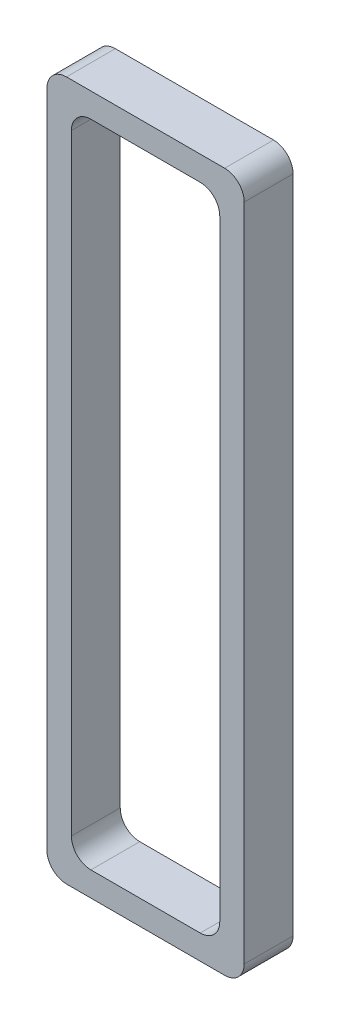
ISO-10303-21;
HEADER;
FILE_DESCRIPTION(('STEP AP214'),'2;1');
FILE_NAME('part.step','',(''),(''),'','','');
FILE_SCHEMA(('AUTOMOTIVE_DESIGN { 1 0 10303 214 1 1 1 1 }'));
ENDSEC;
DATA;
#1=APPLICATION_CONTEXT('core data for automotive mechanical design processes');
#2=APPLICATION_PROTOCOL_DEFINITION('international standard','automotive_design',2000,#1);
#3=PRODUCT_CONTEXT('',#1,'mechanical');
#4=PRODUCT('Part','Part','',(#3));
#5=PRODUCT_RELATED_PRODUCT_CATEGORY('part','',(#4));
#6=PRODUCT_DEFINITION_FORMATION('','',#4);
#7=PRODUCT_DEFINITION_CONTEXT('part definition',#1,'design');
#8=PRODUCT_DEFINITION('design','',#6,#7);
#9=PRODUCT_DEFINITION_SHAPE('','',#8);
#10=(LENGTH_UNIT() NAMED_UNIT(*) SI_UNIT(.MILLI.,.METRE.));
#11=(NAMED_UNIT(*) PLANE_ANGLE_UNIT() SI_UNIT($,.RADIAN.));
#12=(NAMED_UNIT(*) SI_UNIT($,.STERADIAN.) SOLID_ANGLE_UNIT());
#13=UNCERTAINTY_MEASURE_WITH_UNIT(LENGTH_MEASURE(1.E-05),#10,'distance_accuracy_value','');
#14=(GEOMETRIC_REPRESENTATION_CONTEXT(3) GLOBAL_UNCERTAINTY_ASSIGNED_CONTEXT((#13)) GLOBAL_UNIT_ASSIGNED_CONTEXT((#10,
#11,#12)) REPRESENTATION_CONTEXT('',''));
#15=CARTESIAN_POINT('',(0.,0.,0.));
#16=DIRECTION('',(0.,0.,1.));
#17=DIRECTION('',(1.,0.,0.));
#18=AXIS2_PLACEMENT_3D('',#15,#16,#17);
#19=CARTESIAN_POINT('',(23.0898604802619,12.065,6.35));
#20=DIRECTION('',(0.,0.,-1.));
#21=DIRECTION('',(-1.,0.,0.));
#22=AXIS2_PLACEMENT_3D('',#19,#20,#21);
#23=PLANE('',#22);
#24=CARTESIAN_POINT('',(23.0898604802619,12.065,6.35));
#25=DIRECTION('',(0.,0.,1.));
#26=DIRECTION('',(-1.,0.,0.));
#27=AXIS2_PLACEMENT_3D('',#24,#25,#26);
#28=CIRCLE('',#27,2.54);
#29=CARTESIAN_POINT('',(25.6298604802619,12.065,6.35));
#30=VERTEX_POINT('',#29);
#31=CARTESIAN_POINT('',(23.0898604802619,14.605,6.35));
#32=VERTEX_POINT('',#31);
#33=EDGE_CURVE('E208',#30,#32,#28,.T.);
#34=ORIENTED_EDGE('',*,*,#33,.T.);
#35=DIRECTION('',(-1.,0.,0.));
#36=VECTOR('',#35,1.);
#37=CARTESIAN_POINT('',(2.54,14.605,6.35));
#38=LINE('',#37,#36);
#39=CARTESIAN_POINT('',(2.54,14.605,6.35));
#40=VERTEX_POINT('',#39);
#41=EDGE_CURVE('E211',#32,#40,#38,.T.);
#42=ORIENTED_EDGE('',*,*,#41,.T.);
#43=CARTESIAN_POINT('',(2.54,12.065,6.35));
#44=DIRECTION('',(0.,0.,1.));
#45=DIRECTION('',(1.,0.,0.));
#46=AXIS2_PLACEMENT_3D('',#43,#44,#45);
#47=CIRCLE('',#46,2.54);
#48=CARTESIAN_POINT('',(0.,12.065,6.35));
#49=VERTEX_POINT('',#48);
#50=EDGE_CURVE('E214',#40,#49,#47,.T.);
#51=ORIENTED_EDGE('',*,*,#50,.T.);
#52=DIRECTION('',(0.,-1.,0.));
#53=VECTOR('',#52,1.);
#54=CARTESIAN_POINT('',(0.,-73.66,6.35));
#55=LINE('',#54,#53);
#56=CARTESIAN_POINT('',(0.,-73.66,6.35));
#57=VERTEX_POINT('',#56);
#58=EDGE_CURVE('E216',#49,#57,#55,.T.);
#59=ORIENTED_EDGE('',*,*,#58,.T.);
#60=CARTESIAN_POINT('',(2.54,-73.66,6.35));
#61=DIRECTION('',(0.,0.,1.));
#62=DIRECTION('',(-1.,0.,0.));
#63=AXIS2_PLACEMENT_3D('',#60,#61,#62);
#64=CIRCLE('',#63,2.54);
#65=CARTESIAN_POINT('',(2.54000000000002,-76.2,6.35));
#66=VERTEX_POINT('',#65);
#67=EDGE_CURVE('E218',#57,#66,#64,.T.);
#68=ORIENTED_EDGE('',*,*,#67,.T.);
#69=DIRECTION('',(1.,0.,0.));
#70=VECTOR('',#69,1.);
#71=CARTESIAN_POINT('',(23.0898604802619,-76.2,6.35));
#72=LINE('',#71,#70);
#73=CARTESIAN_POINT('',(23.0898604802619,-76.2,6.35));
#74=VERTEX_POINT('',#73);
#75=EDGE_CURVE('E220',#66,#74,#72,.T.);
#76=ORIENTED_EDGE('',*,*,#75,.T.);
#77=CARTESIAN_POINT('',(23.089860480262,-73.66,6.35));
#78=DIRECTION('',(0.,0.,1.));
#79=DIRECTION('',(-1.,0.,0.));
#80=AXIS2_PLACEMENT_3D('',#77,#78,#79);
#81=CIRCLE('',#80,2.54);
#82=CARTESIAN_POINT('',(25.629860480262,-73.66,6.35));
#83=VERTEX_POINT('',#82);
#84=EDGE_CURVE('E222',#74,#83,#81,.T.);
#85=ORIENTED_EDGE('',*,*,#84,.T.);
#86=DIRECTION('',(0.,1.,0.));
#87=VECTOR('',#86,1.);
#88=CARTESIAN_POINT('',(25.6298604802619,12.065,6.35));
#89=LINE('',#88,#87);
#90=EDGE_CURVE('E224',#83,#30,#89,.T.);
#91=ORIENTED_EDGE('',*,*,#90,.T.);
#92=EDGE_LOOP('',(#34,#42,#51,#59,#68,#76,#85,#91));
#93=FACE_BOUND('',#92,.T.);
#94=CARTESIAN_POINT('',(19.9148604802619,8.89,6.35));
#95=DIRECTION('',(0.,0.,1.));
#96=DIRECTION('',(-1.,0.,0.));
#97=AXIS2_PLACEMENT_3D('',#94,#95,#96);
#98=CIRCLE('',#97,2.54);
#99=CARTESIAN_POINT('',(22.4548604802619,8.89,6.35));
#100=VERTEX_POINT('',#99);
#101=CARTESIAN_POINT('',(19.9148604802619,11.43,6.35));
#102=VERTEX_POINT('',#101);
#103=EDGE_CURVE('E143',#100,#102,#98,.T.);
#104=ORIENTED_EDGE('',*,*,#103,.F.);
#105=DIRECTION('',(0.,1.,0.));
#106=VECTOR('',#105,1.);
#107=CARTESIAN_POINT('',(22.4548604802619,8.89,6.35));
#108=LINE('',#107,#106);
#109=CARTESIAN_POINT('',(22.4548604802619,-70.485,6.35));
#110=VERTEX_POINT('',#109);
#111=EDGE_CURVE('E176',#110,#100,#108,.T.);
#112=ORIENTED_EDGE('',*,*,#111,.F.);
#113=CARTESIAN_POINT('',(19.9148604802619,-70.485,6.35));
#114=DIRECTION('',(0.,0.,1.));
#115=DIRECTION('',(-1.,0.,0.));
#116=AXIS2_PLACEMENT_3D('',#113,#114,#115);
#117=CIRCLE('',#116,2.54);
#118=CARTESIAN_POINT('',(19.9148604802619,-73.025,6.35));
#119=VERTEX_POINT('',#118);
#120=EDGE_CURVE('E174',#119,#110,#117,.T.);
#121=ORIENTED_EDGE('',*,*,#120,.F.);
#122=DIRECTION('',(1.,0.,0.));
#123=VECTOR('',#122,1.);
#124=CARTESIAN_POINT('',(19.9148604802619,-73.025,6.35));
#125=LINE('',#124,#123);
#126=CARTESIAN_POINT('',(5.71500000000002,-73.025,6.35));
#127=VERTEX_POINT('',#126);
#128=EDGE_CURVE('E172',#127,#119,#125,.T.);
#129=ORIENTED_EDGE('',*,*,#128,.F.);
#130=CARTESIAN_POINT('',(5.715,-70.485,6.35));
#131=DIRECTION('',(0.,0.,1.));
#132=DIRECTION('',(-1.,0.,0.));
#133=AXIS2_PLACEMENT_3D('',#130,#131,#132);
#134=CIRCLE('',#133,2.54);
#135=CARTESIAN_POINT('',(3.175,-70.485,6.35));
#136=VERTEX_POINT('',#135);
#137=EDGE_CURVE('E170',#136,#127,#134,.T.);
#138=ORIENTED_EDGE('',*,*,#137,.F.);
#139=DIRECTION('',(0.,-1.,0.));
#140=VECTOR('',#139,1.);
#141=CARTESIAN_POINT('',(3.175,-70.485,6.35));
#142=LINE('',#141,#140);
#143=CARTESIAN_POINT('',(3.175,8.89,6.35));
#144=VERTEX_POINT('',#143);
#145=EDGE_CURVE('E166',#144,#136,#142,.T.);
#146=ORIENTED_EDGE('',*,*,#145,.F.);
#147=CARTESIAN_POINT('',(5.715,8.89,6.35));
#148=DIRECTION('',(0.,0.,1.));
#149=DIRECTION('',(1.,0.,0.));
#150=AXIS2_PLACEMENT_3D('',#147,#148,#149);
#151=CIRCLE('',#150,2.54);
#152=CARTESIAN_POINT('',(5.715,11.43,6.35));
#153=VERTEX_POINT('',#152);
#154=EDGE_CURVE('E164',#153,#144,#151,.T.);
#155=ORIENTED_EDGE('',*,*,#154,.F.);
#156=DIRECTION('',(-1.,0.,0.));
#157=VECTOR('',#156,1.);
#158=CARTESIAN_POINT('',(5.715,11.43,6.35));
#159=LINE('',#158,#157);
#160=EDGE_CURVE('E151',#102,#153,#159,.T.);
#161=ORIENTED_EDGE('',*,*,#160,.F.);
#162=EDGE_LOOP('',(#104,#112,#121,#129,#138,#146,#155,#161));
#163=FACE_BOUND('',#162,.T.);
#164=ADVANCED_FACE('F30',(#93,#163),#23,.F.);
#165=CARTESIAN_POINT('',(23.0898604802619,12.065,0.));
#166=DIRECTION('',(0.,0.,-1.));
#167=DIRECTION('',(-1.,0.,0.));
#168=AXIS2_PLACEMENT_3D('',#165,#166,#167);
#169=PLANE('',#168);
#170=CARTESIAN_POINT('',(23.0898604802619,12.065,0.));
#171=DIRECTION('',(0.,0.,1.));
#172=DIRECTION('',(-1.,0.,0.));
#173=AXIS2_PLACEMENT_3D('',#170,#171,#172);
#174=CIRCLE('',#173,2.54);
#175=CARTESIAN_POINT('',(25.6298604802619,12.065,0.));
#176=VERTEX_POINT('',#175);
#177=CARTESIAN_POINT('',(23.0898604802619,14.605,0.));
#178=VERTEX_POINT('',#177);
#179=EDGE_CURVE('E159',#176,#178,#174,.T.);
#180=ORIENTED_EDGE('',*,*,#179,.F.);
#181=DIRECTION('',(0.,1.,0.));
#182=VECTOR('',#181,1.);
#183=CARTESIAN_POINT('',(25.6298604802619,12.065,0.));
#184=LINE('',#183,#182);
#185=CARTESIAN_POINT('',(25.629860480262,-73.66,0.));
#186=VERTEX_POINT('',#185);
#187=EDGE_CURVE('E212',#186,#176,#184,.T.);
#188=ORIENTED_EDGE('',*,*,#187,.F.);
#189=CARTESIAN_POINT('',(23.089860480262,-73.66,0.));
#190=DIRECTION('',(0.,0.,1.));
#191=DIRECTION('',(-1.,0.,0.));
#192=AXIS2_PLACEMENT_3D('',#189,#190,#191);
#193=CIRCLE('',#192,2.54);
#194=CARTESIAN_POINT('',(23.0898604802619,-76.2,0.));
#195=VERTEX_POINT('',#194);
#196=EDGE_CURVE('E239',#195,#186,#193,.T.);
#197=ORIENTED_EDGE('',*,*,#196,.F.);
#198=DIRECTION('',(1.,0.,0.));
#199=VECTOR('',#198,1.);
#200=CARTESIAN_POINT('',(23.0898604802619,-76.2,0.));
#201=LINE('',#200,#199);
#202=CARTESIAN_POINT('',(2.54000000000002,-76.2,0.));
#203=VERTEX_POINT('',#202);
#204=EDGE_CURVE('E237',#203,#195,#201,.T.);
#205=ORIENTED_EDGE('',*,*,#204,.F.);
#206=CARTESIAN_POINT('',(2.54,-73.66,0.));
#207=DIRECTION('',(0.,0.,1.));
#208=DIRECTION('',(-1.,0.,0.));
#209=AXIS2_PLACEMENT_3D('',#206,#207,#208);
#210=CIRCLE('',#209,2.54);
#211=CARTESIAN_POINT('',(0.,-73.66,0.));
#212=VERTEX_POINT('',#211);
#213=EDGE_CURVE('E235',#212,#203,#210,.T.);
#214=ORIENTED_EDGE('',*,*,#213,.F.);
#215=DIRECTION('',(0.,-1.,0.));
#216=VECTOR('',#215,1.);
#217=CARTESIAN_POINT('',(0.,-73.66,0.));
#218=LINE('',#217,#216);
#219=CARTESIAN_POINT('',(0.,12.065,0.));
#220=VERTEX_POINT('',#219);
#221=EDGE_CURVE('E233',#220,#212,#218,.T.);
#222=ORIENTED_EDGE('',*,*,#221,.F.);
#223=CARTESIAN_POINT('',(2.54,12.065,0.));
#224=DIRECTION('',(0.,0.,1.));
#225=DIRECTION('',(1.,0.,0.));
#226=AXIS2_PLACEMENT_3D('',#223,#224,#225);
#227=CIRCLE('',#226,2.54);
#228=CARTESIAN_POINT('',(2.54,14.605,0.));
#229=VERTEX_POINT('',#228);
#230=EDGE_CURVE('E231',#229,#220,#227,.T.);
#231=ORIENTED_EDGE('',*,*,#230,.F.);
#232=DIRECTION('',(-1.,0.,0.));
#233=VECTOR('',#232,1.);
#234=CARTESIAN_POINT('',(2.54,14.605,0.));
#235=LINE('',#234,#233);
#236=EDGE_CURVE('E229',#178,#229,#235,.T.);
#237=ORIENTED_EDGE('',*,*,#236,.F.);
#238=EDGE_LOOP('',(#180,#188,#197,#205,#214,#222,#231,#237));
#239=FACE_BOUND('',#238,.T.);
#240=DIRECTION('',(0.,1.,0.));
#241=VECTOR('',#240,1.);
#242=CARTESIAN_POINT('',(22.4548604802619,8.89,0.));
#243=LINE('',#242,#241);
#244=CARTESIAN_POINT('',(22.4548604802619,-70.485,0.));
#245=VERTEX_POINT('',#244);
#246=CARTESIAN_POINT('',(22.4548604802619,8.89,0.));
#247=VERTEX_POINT('',#246);
#248=EDGE_CURVE('E152',#245,#247,#243,.T.);
#249=ORIENTED_EDGE('',*,*,#248,.T.);
#250=CARTESIAN_POINT('',(19.9148604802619,8.89,0.));
#251=DIRECTION('',(0.,0.,1.));
#252=DIRECTION('',(-1.,0.,0.));
#253=AXIS2_PLACEMENT_3D('',#250,#251,#252);
#254=CIRCLE('',#253,2.54);
#255=CARTESIAN_POINT('',(19.9148604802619,11.43,0.));
#256=VERTEX_POINT('',#255);
#257=EDGE_CURVE('E53',#247,#256,#254,.T.);
#258=ORIENTED_EDGE('',*,*,#257,.T.);
#259=DIRECTION('',(-1.,0.,0.));
#260=VECTOR('',#259,1.);
#261=CARTESIAN_POINT('',(5.715,11.43,0.));
#262=LINE('',#261,#260);
#263=CARTESIAN_POINT('',(5.715,11.43,0.));
#264=VERTEX_POINT('',#263);
#265=EDGE_CURVE('E158',#256,#264,#262,.T.);
#266=ORIENTED_EDGE('',*,*,#265,.T.);
#267=CARTESIAN_POINT('',(5.715,8.89,0.));
#268=DIRECTION('',(0.,0.,1.));
#269=DIRECTION('',(1.,0.,0.));
#270=AXIS2_PLACEMENT_3D('',#267,#268,#269);
#271=CIRCLE('',#270,2.54);
#272=CARTESIAN_POINT('',(3.175,8.89,0.));
#273=VERTEX_POINT('',#272);
#274=EDGE_CURVE('E180',#264,#273,#271,.T.);
#275=ORIENTED_EDGE('',*,*,#274,.T.);
#276=DIRECTION('',(0.,-1.,0.));
#277=VECTOR('',#276,1.);
#278=CARTESIAN_POINT('',(3.175,-70.485,0.));
#279=LINE('',#278,#277);
#280=CARTESIAN_POINT('',(3.175,-70.485,0.));
#281=VERTEX_POINT('',#280);
#282=EDGE_CURVE('E183',#273,#281,#279,.T.);
#283=ORIENTED_EDGE('',*,*,#282,.T.);
#284=CARTESIAN_POINT('',(5.715,-70.485,0.));
#285=DIRECTION('',(0.,0.,1.));
#286=DIRECTION('',(-1.,0.,0.));
#287=AXIS2_PLACEMENT_3D('',#284,#285,#286);
#288=CIRCLE('',#287,2.54);
#289=CARTESIAN_POINT('',(5.71500000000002,-73.025,0.));
#290=VERTEX_POINT('',#289);
#291=EDGE_CURVE('E186',#281,#290,#288,.T.);
#292=ORIENTED_EDGE('',*,*,#291,.T.);
#293=DIRECTION('',(1.,0.,0.));
#294=VECTOR('',#293,1.);
#295=CARTESIAN_POINT('',(19.9148604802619,-73.025,0.));
#296=LINE('',#295,#294);
#297=CARTESIAN_POINT('',(19.9148604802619,-73.025,0.));
#298=VERTEX_POINT('',#297);
#299=EDGE_CURVE('E189',#290,#298,#296,.T.);
#300=ORIENTED_EDGE('',*,*,#299,.T.);
#301=CARTESIAN_POINT('',(19.9148604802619,-70.485,0.));
#302=DIRECTION('',(0.,0.,1.));
#303=DIRECTION('',(-1.,0.,0.));
#304=AXIS2_PLACEMENT_3D('',#301,#302,#303);
#305=CIRCLE('',#304,2.54);
#306=EDGE_CURVE('E192',#298,#245,#305,.T.);
#307=ORIENTED_EDGE('',*,*,#306,.T.);
#308=EDGE_LOOP('',(#249,#258,#266,#275,#283,#292,#300,#307));
#309=FACE_BOUND('',#308,.T.);
#310=ADVANCED_FACE('F269',(#239,#309),#169,.T.);
#311=CARTESIAN_POINT('',(23.0898604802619,12.065,6.35));
#312=DIRECTION('',(0.,0.,-1.));
#313=DIRECTION('',(-1.,0.,0.));
#314=AXIS2_PLACEMENT_3D('',#311,#312,#313);
#315=CYLINDRICAL_SURFACE('',#314,2.54);
#316=ORIENTED_EDGE('',*,*,#179,.T.);
#317=DIRECTION('',(0.,0.,-1.));
#318=VECTOR('',#317,1.);
#319=CARTESIAN_POINT('',(23.0898604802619,14.605,6.35));
#320=LINE('',#319,#318);
#321=EDGE_CURVE('E11',#32,#178,#320,.T.);
#322=ORIENTED_EDGE('',*,*,#321,.F.);
#323=ORIENTED_EDGE('',*,*,#33,.F.);
#324=DIRECTION('',(0.,0.,-1.));
#325=VECTOR('',#324,1.);
#326=CARTESIAN_POINT('',(25.6298604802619,12.065,6.35));
#327=LINE('',#326,#325);
#328=EDGE_CURVE('E226',#30,#176,#327,.T.);
#329=ORIENTED_EDGE('',*,*,#328,.T.);
#330=EDGE_LOOP('',(#316,#322,#323,#329));
#331=FACE_BOUND('',#330,.T.);
#332=ADVANCED_FACE('F32',(#331),#315,.T.);
#333=CARTESIAN_POINT('',(2.54,14.605,6.35));
#334=DIRECTION('',(0.,-1.,0.));
#335=DIRECTION('',(0.,0.,-1.));
#336=AXIS2_PLACEMENT_3D('',#333,#334,#335);
#337=PLANE('',#336);
#338=ORIENTED_EDGE('',*,*,#236,.T.);
#339=DIRECTION('',(0.,0.,-1.));
#340=VECTOR('',#339,1.);
#341=CARTESIAN_POINT('',(2.54,14.605,6.35));
#342=LINE('',#341,#340);
#343=EDGE_CURVE('E38',#40,#229,#342,.T.);
#344=ORIENTED_EDGE('',*,*,#343,.F.);
#345=ORIENTED_EDGE('',*,*,#41,.F.);
#346=ORIENTED_EDGE('',*,*,#321,.T.);
#347=EDGE_LOOP('',(#338,#344,#345,#346));
#348=FACE_BOUND('',#347,.T.);
#349=ADVANCED_FACE('F286',(#348),#337,.F.);
#350=CARTESIAN_POINT('',(2.54,12.065,6.35));
#351=DIRECTION('',(0.,0.,-1.));
#352=DIRECTION('',(-1.,0.,0.));
#353=AXIS2_PLACEMENT_3D('',#350,#351,#352);
#354=CYLINDRICAL_SURFACE('',#353,2.54);
#355=ORIENTED_EDGE('',*,*,#230,.T.);
#356=DIRECTION('',(0.,0.,-1.));
#357=VECTOR('',#356,1.);
#358=CARTESIAN_POINT('',(0.,12.065,6.35));
#359=LINE('',#358,#357);
#360=EDGE_CURVE('E256',#49,#220,#359,.T.);
#361=ORIENTED_EDGE('',*,*,#360,.F.);
#362=ORIENTED_EDGE('',*,*,#50,.F.);
#363=ORIENTED_EDGE('',*,*,#343,.T.);
#364=EDGE_LOOP('',(#355,#361,#362,#363));
#365=FACE_BOUND('',#364,.T.);
#366=ADVANCED_FACE('F263',(#365),#354,.T.);
#367=CARTESIAN_POINT('',(0.,-73.66,6.35));
#368=DIRECTION('',(1.,0.,0.));
#369=DIRECTION('',(0.,0.,-1.));
#370=AXIS2_PLACEMENT_3D('',#367,#368,#369);
#371=PLANE('',#370);
#372=ORIENTED_EDGE('',*,*,#221,.T.);
#373=DIRECTION('',(0.,0.,-1.));
#374=VECTOR('',#373,1.);
#375=CARTESIAN_POINT('',(0.,-73.66,6.35));
#376=LINE('',#375,#374);
#377=EDGE_CURVE('E253',#57,#212,#376,.T.);
#378=ORIENTED_EDGE('',*,*,#377,.F.);
#379=ORIENTED_EDGE('',*,*,#58,.F.);
#380=ORIENTED_EDGE('',*,*,#360,.T.);
#381=EDGE_LOOP('',(#372,#378,#379,#380));
#382=FACE_BOUND('',#381,.T.);
#383=ADVANCED_FACE('F275',(#382),#371,.F.);
#384=CARTESIAN_POINT('',(2.54,-73.66,6.35));
#385=DIRECTION('',(0.,0.,-1.));
#386=DIRECTION('',(-1.,0.,0.));
#387=AXIS2_PLACEMENT_3D('',#384,#385,#386);
#388=CYLINDRICAL_SURFACE('',#387,2.54);
#389=ORIENTED_EDGE('',*,*,#213,.T.);
#390=DIRECTION('',(0.,0.,-1.));
#391=VECTOR('',#390,1.);
#392=CARTESIAN_POINT('',(2.54000000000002,-76.2,6.35));
#393=LINE('',#392,#391);
#394=EDGE_CURVE('E250',#66,#203,#393,.T.);
#395=ORIENTED_EDGE('',*,*,#394,.F.);
#396=ORIENTED_EDGE('',*,*,#67,.F.);
#397=ORIENTED_EDGE('',*,*,#377,.T.);
#398=EDGE_LOOP('',(#389,#395,#396,#397));
#399=FACE_BOUND('',#398,.T.);
#400=ADVANCED_FACE('F279',(#399),#388,.T.);
#401=CARTESIAN_POINT('',(23.0898604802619,-76.2,6.35));
#402=DIRECTION('',(0.,1.,0.));
#403=DIRECTION('',(0.,0.,1.));
#404=AXIS2_PLACEMENT_3D('',#401,#402,#403);
#405=PLANE('',#404);
#406=ORIENTED_EDGE('',*,*,#204,.T.);
#407=DIRECTION('',(0.,0.,-1.));
#408=VECTOR('',#407,1.);
#409=CARTESIAN_POINT('',(23.0898604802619,-76.2,6.35));
#410=LINE('',#409,#408);
#411=EDGE_CURVE('E247',#74,#195,#410,.T.);
#412=ORIENTED_EDGE('',*,*,#411,.F.);
#413=ORIENTED_EDGE('',*,*,#75,.F.);
#414=ORIENTED_EDGE('',*,*,#394,.T.);
#415=EDGE_LOOP('',(#406,#412,#413,#414));
#416=FACE_BOUND('',#415,.T.);
#417=ADVANCED_FACE('F299',(#416),#405,.F.);
#418=CARTESIAN_POINT('',(23.089860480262,-73.66,6.35));
#419=DIRECTION('',(0.,0.,-1.));
#420=DIRECTION('',(-1.,0.,0.));
#421=AXIS2_PLACEMENT_3D('',#418,#419,#420);
#422=CYLINDRICAL_SURFACE('',#421,2.54);
#423=ORIENTED_EDGE('',*,*,#196,.T.);
#424=DIRECTION('',(0.,0.,-1.));
#425=VECTOR('',#424,1.);
#426=CARTESIAN_POINT('',(25.629860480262,-73.66,6.35));
#427=LINE('',#426,#425);
#428=EDGE_CURVE('E244',#83,#186,#427,.T.);
#429=ORIENTED_EDGE('',*,*,#428,.F.);
#430=ORIENTED_EDGE('',*,*,#84,.F.);
#431=ORIENTED_EDGE('',*,*,#411,.T.);
#432=EDGE_LOOP('',(#423,#429,#430,#431));
#433=FACE_BOUND('',#432,.T.);
#434=ADVANCED_FACE('F297',(#433),#422,.T.);
#435=CARTESIAN_POINT('',(25.6298604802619,12.065,6.35));
#436=DIRECTION('',(-1.,0.,0.));
#437=DIRECTION('',(0.,-1.,0.));
#438=AXIS2_PLACEMENT_3D('',#435,#436,#437);
#439=PLANE('',#438);
#440=ORIENTED_EDGE('',*,*,#187,.T.);
#441=ORIENTED_EDGE('',*,*,#328,.F.);
#442=ORIENTED_EDGE('',*,*,#90,.F.);
#443=ORIENTED_EDGE('',*,*,#428,.T.);
#444=EDGE_LOOP('',(#440,#441,#442,#443));
#445=FACE_BOUND('',#444,.T.);
#446=ADVANCED_FACE('F292',(#445),#439,.F.);
#447=CARTESIAN_POINT('',(19.9148604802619,8.89,6.35));
#448=DIRECTION('',(0.,0.,-1.));
#449=DIRECTION('',(-1.,0.,0.));
#450=AXIS2_PLACEMENT_3D('',#447,#448,#449);
#451=CYLINDRICAL_SURFACE('',#450,2.54);
#452=ORIENTED_EDGE('',*,*,#257,.F.);
#453=DIRECTION('',(0.,0.,-1.));
#454=VECTOR('',#453,1.);
#455=CARTESIAN_POINT('',(22.4548604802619,8.89,6.35));
#456=LINE('',#455,#454);
#457=EDGE_CURVE('E147',#100,#247,#456,.T.);
#458=ORIENTED_EDGE('',*,*,#457,.F.);
#459=ORIENTED_EDGE('',*,*,#103,.T.);
#460=DIRECTION('',(0.,0.,-1.));
#461=VECTOR('',#460,1.);
#462=CARTESIAN_POINT('',(19.9148604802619,11.43,6.35));
#463=LINE('',#462,#461);
#464=EDGE_CURVE('E146',#102,#256,#463,.T.);
#465=ORIENTED_EDGE('',*,*,#464,.T.);
#466=EDGE_LOOP('',(#452,#458,#459,#465));
#467=FACE_BOUND('',#466,.T.);
#468=ADVANCED_FACE('F145',(#467),#451,.F.);
#469=CARTESIAN_POINT('',(5.715,11.43,6.35));
#470=DIRECTION('',(0.,-1.,0.));
#471=DIRECTION('',(0.,0.,-1.));
#472=AXIS2_PLACEMENT_3D('',#469,#470,#471);
#473=PLANE('',#472);
#474=ORIENTED_EDGE('',*,*,#265,.F.);
#475=ORIENTED_EDGE('',*,*,#464,.F.);
#476=ORIENTED_EDGE('',*,*,#160,.T.);
#477=DIRECTION('',(0.,0.,-1.));
#478=VECTOR('',#477,1.);
#479=CARTESIAN_POINT('',(5.715,11.43,6.35));
#480=LINE('',#479,#478);
#481=EDGE_CURVE('E160',#153,#264,#480,.T.);
#482=ORIENTED_EDGE('',*,*,#481,.T.);
#483=EDGE_LOOP('',(#474,#475,#476,#482));
#484=FACE_BOUND('',#483,.T.);
#485=ADVANCED_FACE('F155',(#484),#473,.T.);
#486=CARTESIAN_POINT('',(5.715,8.89,6.35));
#487=DIRECTION('',(0.,0.,-1.));
#488=DIRECTION('',(-1.,0.,0.));
#489=AXIS2_PLACEMENT_3D('',#486,#487,#488);
#490=CYLINDRICAL_SURFACE('',#489,2.54);
#491=ORIENTED_EDGE('',*,*,#274,.F.);
#492=ORIENTED_EDGE('',*,*,#481,.F.);
#493=ORIENTED_EDGE('',*,*,#154,.T.);
#494=DIRECTION('',(0.,0.,-1.));
#495=VECTOR('',#494,1.);
#496=CARTESIAN_POINT('',(3.175,8.89,6.35));
#497=LINE('',#496,#495);
#498=EDGE_CURVE('E205',#144,#273,#497,.T.);
#499=ORIENTED_EDGE('',*,*,#498,.T.);
#500=EDGE_LOOP('',(#491,#492,#493,#499));
#501=FACE_BOUND('',#500,.T.);
#502=ADVANCED_FACE('F324',(#501),#490,.F.);
#503=CARTESIAN_POINT('',(3.175,-70.485,6.35));
#504=DIRECTION('',(1.,0.,0.));
#505=DIRECTION('',(0.,0.,-1.));
#506=AXIS2_PLACEMENT_3D('',#503,#504,#505);
#507=PLANE('',#506);
#508=ORIENTED_EDGE('',*,*,#282,.F.);
#509=ORIENTED_EDGE('',*,*,#498,.F.);
#510=ORIENTED_EDGE('',*,*,#145,.T.);
#511=DIRECTION('',(0.,0.,-1.));
#512=VECTOR('',#511,1.);
#513=CARTESIAN_POINT('',(3.175,-70.485,6.35));
#514=LINE('',#513,#512);
#515=EDGE_CURVE('E203',#136,#281,#514,.T.);
#516=ORIENTED_EDGE('',*,*,#515,.T.);
#517=EDGE_LOOP('',(#508,#509,#510,#516));
#518=FACE_BOUND('',#517,.T.);
#519=ADVANCED_FACE('F328',(#518),#507,.T.);
#520=CARTESIAN_POINT('',(5.715,-70.485,6.35));
#521=DIRECTION('',(0.,0.,-1.));
#522=DIRECTION('',(-1.,0.,0.));
#523=AXIS2_PLACEMENT_3D('',#520,#521,#522);
#524=CYLINDRICAL_SURFACE('',#523,2.54);
#525=ORIENTED_EDGE('',*,*,#291,.F.);
#526=ORIENTED_EDGE('',*,*,#515,.F.);
#527=ORIENTED_EDGE('',*,*,#137,.T.);
#528=DIRECTION('',(0.,0.,-1.));
#529=VECTOR('',#528,1.);
#530=CARTESIAN_POINT('',(5.71500000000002,-73.025,6.35));
#531=LINE('',#530,#529);
#532=EDGE_CURVE('E201',#127,#290,#531,.T.);
#533=ORIENTED_EDGE('',*,*,#532,.T.);
#534=EDGE_LOOP('',(#525,#526,#527,#533));
#535=FACE_BOUND('',#534,.T.);
#536=ADVANCED_FACE('F334',(#535),#524,.F.);
#537=CARTESIAN_POINT('',(19.9148604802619,-73.025,6.35));
#538=DIRECTION('',(0.,1.,0.));
#539=DIRECTION('',(0.,0.,1.));
#540=AXIS2_PLACEMENT_3D('',#537,#538,#539);
#541=PLANE('',#540);
#542=ORIENTED_EDGE('',*,*,#299,.F.);
#543=ORIENTED_EDGE('',*,*,#532,.F.);
#544=ORIENTED_EDGE('',*,*,#128,.T.);
#545=DIRECTION('',(0.,0.,-1.));
#546=VECTOR('',#545,1.);
#547=CARTESIAN_POINT('',(19.9148604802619,-73.025,6.35));
#548=LINE('',#547,#546);
#549=EDGE_CURVE('E199',#119,#298,#548,.T.);
#550=ORIENTED_EDGE('',*,*,#549,.T.);
#551=EDGE_LOOP('',(#542,#543,#544,#550));
#552=FACE_BOUND('',#551,.T.);
#553=ADVANCED_FACE('F338',(#552),#541,.T.);
#554=CARTESIAN_POINT('',(19.9148604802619,-70.485,6.35));
#555=DIRECTION('',(0.,0.,-1.));
#556=DIRECTION('',(-1.,0.,0.));
#557=AXIS2_PLACEMENT_3D('',#554,#555,#556);
#558=CYLINDRICAL_SURFACE('',#557,2.54);
#559=ORIENTED_EDGE('',*,*,#306,.F.);
#560=ORIENTED_EDGE('',*,*,#549,.F.);
#561=ORIENTED_EDGE('',*,*,#120,.T.);
#562=DIRECTION('',(0.,0.,-1.));
#563=VECTOR('',#562,1.);
#564=CARTESIAN_POINT('',(22.4548604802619,-70.485,6.35));
#565=LINE('',#564,#563);
#566=EDGE_CURVE('E45',#110,#245,#565,.T.);
#567=ORIENTED_EDGE('',*,*,#566,.T.);
#568=EDGE_LOOP('',(#559,#560,#561,#567));
#569=FACE_BOUND('',#568,.T.);
#570=ADVANCED_FACE('F342',(#569),#558,.F.);
#571=CARTESIAN_POINT('',(22.4548604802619,8.89,6.35));
#572=DIRECTION('',(-1.,0.,0.));
#573=DIRECTION('',(0.,-1.,0.));
#574=AXIS2_PLACEMENT_3D('',#571,#572,#573);
#575=PLANE('',#574);
#576=ORIENTED_EDGE('',*,*,#248,.F.);
#577=ORIENTED_EDGE('',*,*,#566,.F.);
#578=ORIENTED_EDGE('',*,*,#111,.T.);
#579=ORIENTED_EDGE('',*,*,#457,.T.);
#580=EDGE_LOOP('',(#576,#577,#578,#579));
#581=FACE_BOUND('',#580,.T.);
#582=ADVANCED_FACE('F346',(#581),#575,.T.);
#583=CLOSED_SHELL('',(#164,#310,#332,#349,#366,#383,#400,#417,#434,#446,#468,#485,#502,#519,
#536,#553,#570,#582));
#584=MANIFOLD_SOLID_BREP('B2',#583);
#585=ADVANCED_BREP_SHAPE_REPRESENTATION('',(#18,#584),#14);
#586=SHAPE_DEFINITION_REPRESENTATION(#9,#585);
ENDSEC;
END-ISO-10303-21;
